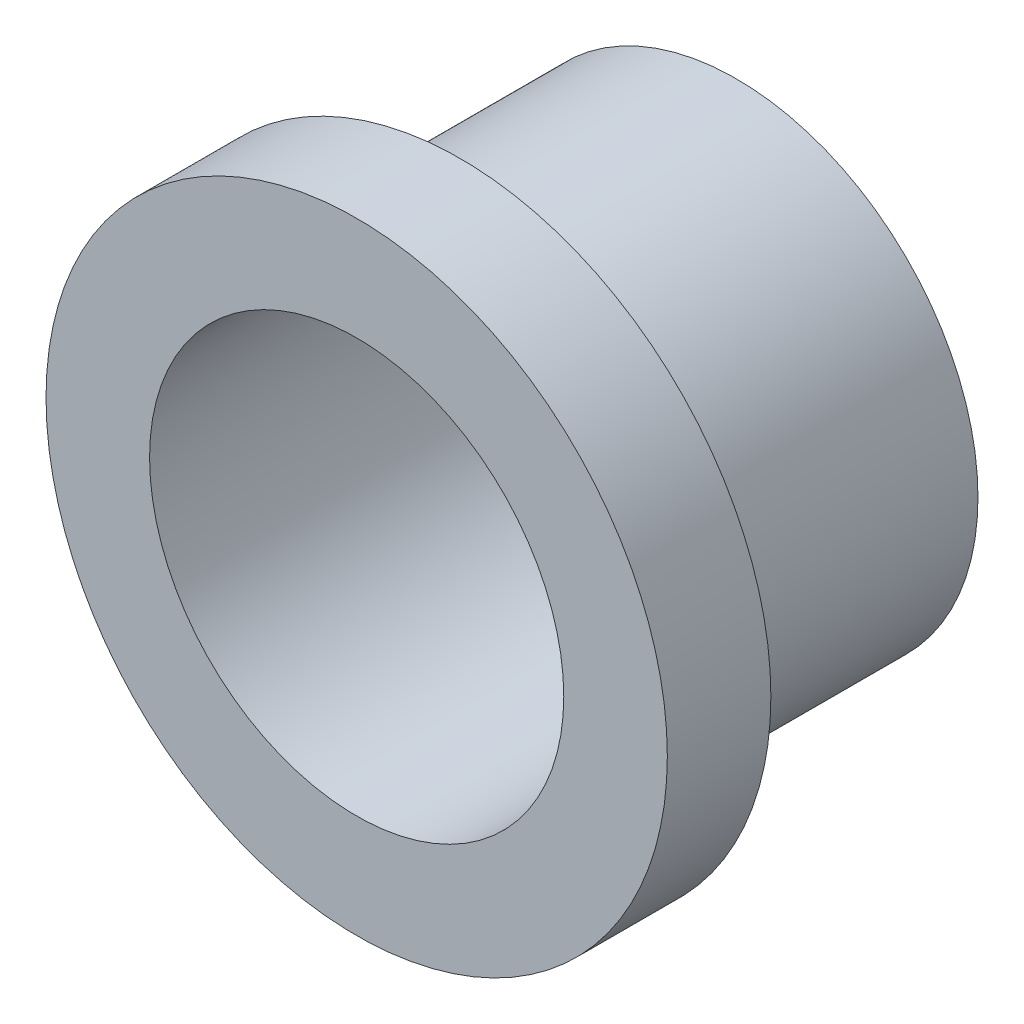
ISO-10303-21;
HEADER;
FILE_DESCRIPTION(('STEP AP214'),'2;1');
FILE_NAME('part.step','',(''),(''),'','','');
FILE_SCHEMA(('AUTOMOTIVE_DESIGN { 1 0 10303 214 1 1 1 1 }'));
ENDSEC;
DATA;
#1=APPLICATION_CONTEXT('core data for automotive mechanical design processes');
#2=APPLICATION_PROTOCOL_DEFINITION('international standard','automotive_design',2000,#1);
#3=PRODUCT_CONTEXT('',#1,'mechanical');
#4=PRODUCT('Part','Part','',(#3));
#5=PRODUCT_RELATED_PRODUCT_CATEGORY('part','',(#4));
#6=PRODUCT_DEFINITION_FORMATION('','',#4);
#7=PRODUCT_DEFINITION_CONTEXT('part definition',#1,'design');
#8=PRODUCT_DEFINITION('design','',#6,#7);
#9=PRODUCT_DEFINITION_SHAPE('','',#8);
#10=(LENGTH_UNIT() NAMED_UNIT(*) SI_UNIT(.MILLI.,.METRE.));
#11=(NAMED_UNIT(*) PLANE_ANGLE_UNIT() SI_UNIT($,.RADIAN.));
#12=(NAMED_UNIT(*) SI_UNIT($,.STERADIAN.) SOLID_ANGLE_UNIT());
#13=UNCERTAINTY_MEASURE_WITH_UNIT(LENGTH_MEASURE(1.E-05),#10,'distance_accuracy_value','');
#14=(GEOMETRIC_REPRESENTATION_CONTEXT(3) GLOBAL_UNCERTAINTY_ASSIGNED_CONTEXT((#13)) GLOBAL_UNIT_ASSIGNED_CONTEXT((#10,
#11,#12)) REPRESENTATION_CONTEXT('',''));
#15=CARTESIAN_POINT('',(0.,0.,0.));
#16=DIRECTION('',(0.,0.,1.));
#17=DIRECTION('',(1.,0.,0.));
#18=AXIS2_PLACEMENT_3D('',#15,#16,#17);
#19=CARTESIAN_POINT('',(0.,0.,8.));
#20=DIRECTION('',(0.,0.,-1.));
#21=DIRECTION('',(-1.,0.,0.));
#22=AXIS2_PLACEMENT_3D('',#19,#20,#21);
#23=CYLINDRICAL_SURFACE('',#22,7.);
#24=CARTESIAN_POINT('',(0.,0.,8.));
#25=DIRECTION('',(0.,0.,1.));
#26=DIRECTION('',(1.,0.,0.));
#27=AXIS2_PLACEMENT_3D('',#24,#25,#26);
#28=CIRCLE('',#27,7.);
#29=CARTESIAN_POINT('',(7.,0.,8.));
#30=VERTEX_POINT('',#29);
#31=EDGE_CURVE('E10',#30,#30,#28,.T.);
#32=ORIENTED_EDGE('',*,*,#31,.F.);
#33=EDGE_LOOP('',(#32));
#34=FACE_BOUND('',#33,.T.);
#35=CARTESIAN_POINT('',(0.,0.,0.));
#36=DIRECTION('',(0.,0.,1.));
#37=DIRECTION('',(1.,0.,0.));
#38=AXIS2_PLACEMENT_3D('',#35,#36,#37);
#39=CIRCLE('',#38,7.);
#40=CARTESIAN_POINT('',(7.,0.,0.));
#41=VERTEX_POINT('',#40);
#42=EDGE_CURVE('E40',#41,#41,#39,.T.);
#43=ORIENTED_EDGE('',*,*,#42,.T.);
#44=EDGE_LOOP('',(#43));
#45=FACE_BOUND('',#44,.T.);
#46=ADVANCED_FACE('F37',(#34,#45),#23,.T.);
#47=CARTESIAN_POINT('',(0.,0.,0.));
#48=DIRECTION('',(0.,0.,1.));
#49=DIRECTION('',(1.,0.,0.));
#50=AXIS2_PLACEMENT_3D('',#47,#48,#49);
#51=PLANE('',#50);
#52=CARTESIAN_POINT('',(0.,0.,0.));
#53=DIRECTION('',(0.,0.,1.));
#54=DIRECTION('',(1.,0.,0.));
#55=AXIS2_PLACEMENT_3D('',#52,#53,#54);
#56=CIRCLE('',#55,6.);
#57=CARTESIAN_POINT('',(6.,0.,0.));
#58=VERTEX_POINT('',#57);
#59=EDGE_CURVE('E55',#58,#58,#56,.T.);
#60=ORIENTED_EDGE('',*,*,#59,.T.);
#61=EDGE_LOOP('',(#60));
#62=FACE_BOUND('',#61,.T.);
#63=ORIENTED_EDGE('',*,*,#42,.F.);
#64=EDGE_LOOP('',(#63));
#65=FACE_BOUND('',#64,.T.);
#66=ADVANCED_FACE('F80',(#62,#65),#51,.F.);
#67=CARTESIAN_POINT('',(0.,0.,11.));
#68=DIRECTION('',(0.,0.,-1.));
#69=DIRECTION('',(-1.,0.,0.));
#70=AXIS2_PLACEMENT_3D('',#67,#68,#69);
#71=CYLINDRICAL_SURFACE('',#70,9.);
#72=CARTESIAN_POINT('',(0.,0.,11.));
#73=DIRECTION('',(0.,0.,1.));
#74=DIRECTION('',(1.,0.,0.));
#75=AXIS2_PLACEMENT_3D('',#72,#73,#74);
#76=CIRCLE('',#75,9.);
#77=CARTESIAN_POINT('',(9.,0.,11.));
#78=VERTEX_POINT('',#77);
#79=EDGE_CURVE('E49',#78,#78,#76,.T.);
#80=ORIENTED_EDGE('',*,*,#79,.F.);
#81=EDGE_LOOP('',(#80));
#82=FACE_BOUND('',#81,.T.);
#83=CARTESIAN_POINT('',(0.,0.,8.));
#84=DIRECTION('',(0.,0.,1.));
#85=DIRECTION('',(1.,0.,0.));
#86=AXIS2_PLACEMENT_3D('',#83,#84,#85);
#87=CIRCLE('',#86,9.);
#88=CARTESIAN_POINT('',(9.,0.,8.));
#89=VERTEX_POINT('',#88);
#90=EDGE_CURVE('E51',#89,#89,#87,.T.);
#91=ORIENTED_EDGE('',*,*,#90,.T.);
#92=EDGE_LOOP('',(#91));
#93=FACE_BOUND('',#92,.T.);
#94=ADVANCED_FACE('F74',(#82,#93),#71,.T.);
#95=CARTESIAN_POINT('',(0.,0.,11.));
#96=DIRECTION('',(0.,0.,1.));
#97=DIRECTION('',(1.,0.,0.));
#98=AXIS2_PLACEMENT_3D('',#95,#96,#97);
#99=PLANE('',#98);
#100=CARTESIAN_POINT('',(0.,0.,11.));
#101=DIRECTION('',(0.,0.,1.));
#102=DIRECTION('',(1.,0.,0.));
#103=AXIS2_PLACEMENT_3D('',#100,#101,#102);
#104=CIRCLE('',#103,6.);
#105=CARTESIAN_POINT('',(6.,0.,11.));
#106=VERTEX_POINT('',#105);
#107=EDGE_CURVE('E62',#106,#106,#104,.T.);
#108=ORIENTED_EDGE('',*,*,#107,.F.);
#109=EDGE_LOOP('',(#108));
#110=FACE_BOUND('',#109,.T.);
#111=ORIENTED_EDGE('',*,*,#79,.T.);
#112=EDGE_LOOP('',(#111));
#113=FACE_BOUND('',#112,.T.);
#114=ADVANCED_FACE('F70',(#110,#113),#99,.T.);
#115=CARTESIAN_POINT('',(0.,0.,8.));
#116=DIRECTION('',(0.,0.,1.));
#117=DIRECTION('',(1.,0.,0.));
#118=AXIS2_PLACEMENT_3D('',#115,#116,#117);
#119=PLANE('',#118);
#120=ORIENTED_EDGE('',*,*,#31,.T.);
#121=EDGE_LOOP('',(#120));
#122=FACE_BOUND('',#121,.T.);
#123=ORIENTED_EDGE('',*,*,#90,.F.);
#124=EDGE_LOOP('',(#123));
#125=FACE_BOUND('',#124,.T.);
#126=ADVANCED_FACE('F73',(#122,#125),#119,.F.);
#127=CARTESIAN_POINT('',(0.,0.,11.));
#128=DIRECTION('',(0.,0.,1.));
#129=DIRECTION('',(1.,0.,0.));
#130=AXIS2_PLACEMENT_3D('',#127,#128,#129);
#131=CYLINDRICAL_SURFACE('',#130,6.);
#132=ORIENTED_EDGE('',*,*,#107,.T.);
#133=EDGE_LOOP('',(#132));
#134=FACE_BOUND('',#133,.T.);
#135=ORIENTED_EDGE('',*,*,#59,.F.);
#136=EDGE_LOOP('',(#135));
#137=FACE_BOUND('',#136,.T.);
#138=ADVANCED_FACE('F67',(#134,#137),#131,.F.);
#139=CLOSED_SHELL('',(#46,#66,#94,#114,#126,#138));
#140=MANIFOLD_SOLID_BREP('B2',#139);
#141=ADVANCED_BREP_SHAPE_REPRESENTATION('',(#18,#140),#14);
#142=SHAPE_DEFINITION_REPRESENTATION(#9,#141);
ENDSEC;
END-ISO-10303-21;
